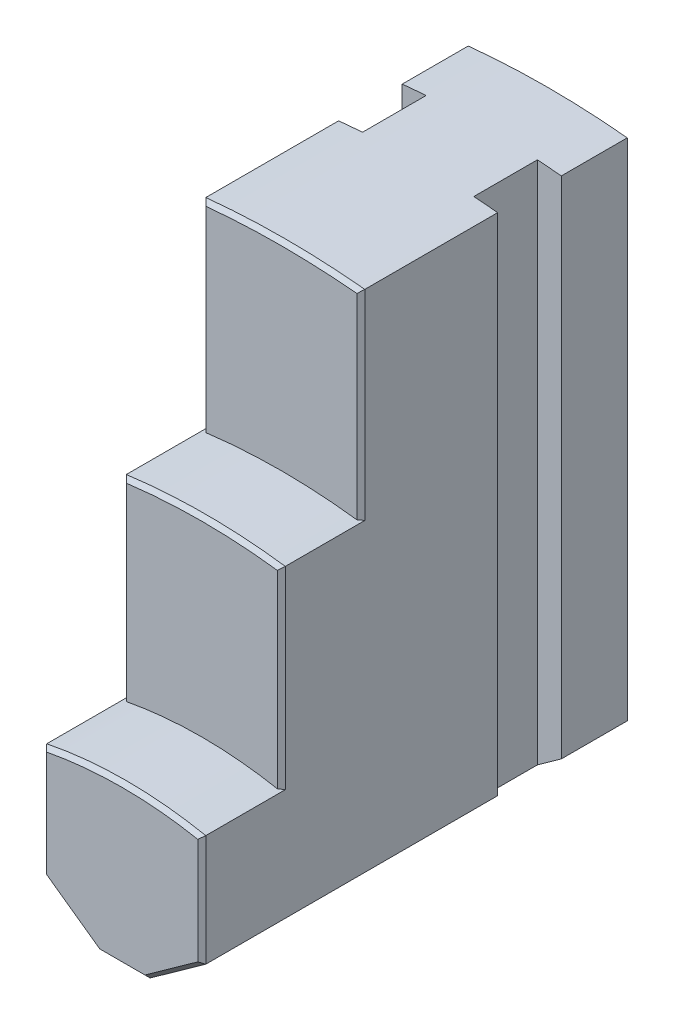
ISO-10303-21;
HEADER;
FILE_DESCRIPTION(('STEP AP214'),'2;1');
FILE_NAME('part.step','',(''),(''),'','','');
FILE_SCHEMA(('AUTOMOTIVE_DESIGN { 1 0 10303 214 1 1 1 1 }'));
ENDSEC;
DATA;
#1=APPLICATION_CONTEXT('core data for automotive mechanical design processes');
#2=APPLICATION_PROTOCOL_DEFINITION('international standard','automotive_design',2000,#1);
#3=PRODUCT_CONTEXT('',#1,'mechanical');
#4=PRODUCT('Part','Part','',(#3));
#5=PRODUCT_RELATED_PRODUCT_CATEGORY('part','',(#4));
#6=PRODUCT_DEFINITION_FORMATION('','',#4);
#7=PRODUCT_DEFINITION_CONTEXT('part definition',#1,'design');
#8=PRODUCT_DEFINITION('design','',#6,#7);
#9=PRODUCT_DEFINITION_SHAPE('','',#8);
#10=(LENGTH_UNIT() NAMED_UNIT(*) SI_UNIT(.MILLI.,.METRE.));
#11=(NAMED_UNIT(*) PLANE_ANGLE_UNIT() SI_UNIT($,.RADIAN.));
#12=(NAMED_UNIT(*) SI_UNIT($,.STERADIAN.) SOLID_ANGLE_UNIT());
#13=UNCERTAINTY_MEASURE_WITH_UNIT(LENGTH_MEASURE(1.E-05),#10,'distance_accuracy_value','');
#14=(GEOMETRIC_REPRESENTATION_CONTEXT(3) GLOBAL_UNCERTAINTY_ASSIGNED_CONTEXT((#13)) GLOBAL_UNIT_ASSIGNED_CONTEXT((#10,
#11,#12)) REPRESENTATION_CONTEXT('',''));
#15=CARTESIAN_POINT('',(0.,0.,0.));
#16=DIRECTION('',(0.,0.,1.));
#17=DIRECTION('',(1.,0.,0.));
#18=AXIS2_PLACEMENT_3D('',#15,#16,#17);
#19=CARTESIAN_POINT('',(10.,5.,32.5));
#20=DIRECTION('',(-1.,0.,0.));
#21=DIRECTION('',(0.,-1.,0.));
#22=AXIS2_PLACEMENT_3D('',#19,#20,#21);
#23=PLANE('',#22);
#24=DIRECTION('',(0.,0.,1.));
#25=VECTOR('',#24,1.);
#26=CARTESIAN_POINT('',(10.,19.0099990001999,22.5));
#27=LINE('',#26,#25);
#28=CARTESIAN_POINT('',(10.,19.0099990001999,32.));
#29=VERTEX_POINT('',#28);
#30=CARTESIAN_POINT('',(10.,19.0099990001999,22.));
#31=VERTEX_POINT('',#30);
#32=EDGE_CURVE('E361',#29,#31,#27,.F.);
#33=ORIENTED_EDGE('',*,*,#32,.F.);
#34=DIRECTION('',(0.,-1.,0.));
#35=VECTOR('',#34,1.);
#36=CARTESIAN_POINT('',(10.,5.,32.));
#37=LINE('',#36,#35);
#38=CARTESIAN_POINT('',(10.,5.,32.));
#39=VERTEX_POINT('',#38);
#40=EDGE_CURVE('E326',#29,#39,#37,.T.);
#41=ORIENTED_EDGE('',*,*,#40,.T.);
#42=DIRECTION('',(0.,0.,-1.));
#43=VECTOR('',#42,1.);
#44=CARTESIAN_POINT('',(10.,5.,32.5));
#45=LINE('',#44,#43);
#46=CARTESIAN_POINT('',(10.,5.,-4.7));
#47=VERTEX_POINT('',#46);
#48=EDGE_CURVE('E269',#39,#47,#45,.T.);
#49=ORIENTED_EDGE('',*,*,#48,.T.);
#50=DIRECTION('',(0.,-1.,0.));
#51=VECTOR('',#50,1.);
#52=CARTESIAN_POINT('',(10.,5.,-4.7));
#53=LINE('',#52,#51);
#54=CARTESIAN_POINT('',(10.,68.498743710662,-4.7));
#55=VERTEX_POINT('',#54);
#56=EDGE_CURVE('E288',#55,#47,#53,.T.);
#57=ORIENTED_EDGE('',*,*,#56,.F.);
#58=DIRECTION('',(0.,0.,-1.));
#59=VECTOR('',#58,1.);
#60=CARTESIAN_POINT('',(10.,68.498743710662,32.5));
#61=LINE('',#60,#59);
#62=CARTESIAN_POINT('',(10.,68.498743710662,12.));
#63=VERTEX_POINT('',#62);
#64=EDGE_CURVE('E224',#63,#55,#61,.T.);
#65=ORIENTED_EDGE('',*,*,#64,.F.);
#66=DIRECTION('',(0.,-1.,0.));
#67=VECTOR('',#66,1.);
#68=CARTESIAN_POINT('',(10.,43.3303437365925,12.));
#69=LINE('',#68,#67);
#70=CARTESIAN_POINT('',(10.,43.3303437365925,12.));
#71=VERTEX_POINT('',#70);
#72=EDGE_CURVE('E320',#63,#71,#69,.T.);
#73=ORIENTED_EDGE('',*,*,#72,.T.);
#74=DIRECTION('',(0.,0.,1.));
#75=VECTOR('',#74,1.);
#76=CARTESIAN_POINT('',(10.,43.3303437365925,12.5));
#77=LINE('',#76,#75);
#78=CARTESIAN_POINT('',(10.,43.3303437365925,22.));
#79=VERTEX_POINT('',#78);
#80=EDGE_CURVE('E220',#79,#71,#77,.F.);
#81=ORIENTED_EDGE('',*,*,#80,.F.);
#82=DIRECTION('',(0.,-1.,0.));
#83=VECTOR('',#82,1.);
#84=CARTESIAN_POINT('',(10.,19.0099990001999,22.));
#85=LINE('',#84,#83);
#86=EDGE_CURVE('E323',#79,#31,#85,.T.);
#87=ORIENTED_EDGE('',*,*,#86,.T.);
#88=EDGE_LOOP('',(#33,#41,#49,#57,#65,#73,#81,#87));
#89=FACE_BOUND('',#88,.T.);
#90=ADVANCED_FACE('F29',(#89),#23,.F.);
#91=CARTESIAN_POINT('',(-10.,5.,32.5));
#92=DIRECTION('',(1.,0.,0.));
#93=DIRECTION('',(0.,1.,0.));
#94=AXIS2_PLACEMENT_3D('',#91,#92,#93);
#95=PLANE('',#94);
#96=DIRECTION('',(0.,0.,-1.));
#97=VECTOR('',#96,1.);
#98=CARTESIAN_POINT('',(-10.,5.,32.5));
#99=LINE('',#98,#97);
#100=CARTESIAN_POINT('',(-10.,5.,32.));
#101=VERTEX_POINT('',#100);
#102=CARTESIAN_POINT('',(-10.,5.,-4.7));
#103=VERTEX_POINT('',#102);
#104=EDGE_CURVE('E276',#101,#103,#99,.T.);
#105=ORIENTED_EDGE('',*,*,#104,.F.);
#106=DIRECTION('',(0.,1.,0.));
#107=VECTOR('',#106,1.);
#108=CARTESIAN_POINT('',(-10.,19.0099990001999,32.));
#109=LINE('',#108,#107);
#110=CARTESIAN_POINT('',(-10.,19.0099990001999,32.));
#111=VERTEX_POINT('',#110);
#112=EDGE_CURVE('E311',#101,#111,#109,.T.);
#113=ORIENTED_EDGE('',*,*,#112,.T.);
#114=DIRECTION('',(0.,0.,1.));
#115=VECTOR('',#114,1.);
#116=CARTESIAN_POINT('',(-10.,19.0099990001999,22.5));
#117=LINE('',#116,#115);
#118=CARTESIAN_POINT('',(-10.,19.0099990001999,22.));
#119=VERTEX_POINT('',#118);
#120=EDGE_CURVE('E421',#119,#111,#117,.T.);
#121=ORIENTED_EDGE('',*,*,#120,.F.);
#122=DIRECTION('',(0.,1.,0.));
#123=VECTOR('',#122,1.);
#124=CARTESIAN_POINT('',(-10.,43.3303437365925,22.));
#125=LINE('',#124,#123);
#126=CARTESIAN_POINT('',(-10.,43.3303437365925,22.));
#127=VERTEX_POINT('',#126);
#128=EDGE_CURVE('E309',#119,#127,#125,.T.);
#129=ORIENTED_EDGE('',*,*,#128,.T.);
#130=DIRECTION('',(0.,0.,1.));
#131=VECTOR('',#130,1.);
#132=CARTESIAN_POINT('',(-10.,43.3303437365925,12.5));
#133=LINE('',#132,#131);
#134=CARTESIAN_POINT('',(-10.,43.3303437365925,12.));
#135=VERTEX_POINT('',#134);
#136=EDGE_CURVE('E360',#135,#127,#133,.T.);
#137=ORIENTED_EDGE('',*,*,#136,.F.);
#138=DIRECTION('',(0.,1.,0.));
#139=VECTOR('',#138,1.);
#140=CARTESIAN_POINT('',(-10.,68.498743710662,12.));
#141=LINE('',#140,#139);
#142=CARTESIAN_POINT('',(-10.,68.498743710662,12.));
#143=VERTEX_POINT('',#142);
#144=EDGE_CURVE('E307',#135,#143,#141,.T.);
#145=ORIENTED_EDGE('',*,*,#144,.T.);
#146=DIRECTION('',(0.,0.,-1.));
#147=VECTOR('',#146,1.);
#148=CARTESIAN_POINT('',(-10.,68.498743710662,32.5));
#149=LINE('',#148,#147);
#150=CARTESIAN_POINT('',(-10.,68.498743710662,-4.7));
#151=VERTEX_POINT('',#150);
#152=EDGE_CURVE('E279',#143,#151,#149,.T.);
#153=ORIENTED_EDGE('',*,*,#152,.T.);
#154=DIRECTION('',(0.,1.,0.));
#155=VECTOR('',#154,1.);
#156=CARTESIAN_POINT('',(-10.,5.,-4.7));
#157=LINE('',#156,#155);
#158=EDGE_CURVE('E243',#103,#151,#157,.T.);
#159=ORIENTED_EDGE('',*,*,#158,.F.);
#160=EDGE_LOOP('',(#105,#113,#121,#129,#137,#145,#153,#159));
#161=FACE_BOUND('',#160,.T.);
#162=ADVANCED_FACE('F376',(#161),#95,.F.);
#163=CARTESIAN_POINT('',(0.,-31.,32.5));
#164=DIRECTION('',(0.,0.,1.));
#165=DIRECTION('',(1.,0.,0.));
#166=AXIS2_PLACEMENT_3D('',#163,#164,#165);
#167=PLANE('',#166);
#168=CARTESIAN_POINT('',(0.,-31.,32.5));
#169=DIRECTION('',(0.,0.,1.));
#170=DIRECTION('',(1.,0.,0.));
#171=AXIS2_PLACEMENT_3D('',#168,#169,#170);
#172=CIRCLE('',#171,50.5);
#173=CARTESIAN_POINT('',(9.5,18.598387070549,32.5));
#174=VERTEX_POINT('',#173);
#175=CARTESIAN_POINT('',(-9.5,18.598387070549,32.5));
#176=VERTEX_POINT('',#175);
#177=EDGE_CURVE('E294',#174,#176,#172,.T.);
#178=ORIENTED_EDGE('',*,*,#177,.T.);
#179=DIRECTION('',(0.,-1.,0.));
#180=VECTOR('',#179,1.);
#181=CARTESIAN_POINT('',(-9.5,5.,32.5));
#182=LINE('',#181,#180);
#183=CARTESIAN_POINT('',(-9.5,5.2573089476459,32.5));
#184=VERTEX_POINT('',#183);
#185=EDGE_CURVE('E304',#176,#184,#182,.T.);
#186=ORIENTED_EDGE('',*,*,#185,.T.);
#187=DIRECTION('',(0.813733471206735,-0.581238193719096,0.));
#188=VECTOR('',#187,1.);
#189=CARTESIAN_POINT('',(-2.70938090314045,0.406866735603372,32.5));
#190=LINE('',#189,#188);
#191=CARTESIAN_POINT('',(-2.83976747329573,0.5,32.5));
#192=VERTEX_POINT('',#191);
#193=EDGE_CURVE('E302',#184,#192,#190,.T.);
#194=ORIENTED_EDGE('',*,*,#193,.T.);
#195=DIRECTION('',(1.,0.,0.));
#196=VECTOR('',#195,1.);
#197=CARTESIAN_POINT('',(3.,0.5,32.5));
#198=LINE('',#197,#196);
#199=CARTESIAN_POINT('',(2.83976747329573,0.5,32.5));
#200=VERTEX_POINT('',#199);
#201=EDGE_CURVE('E300',#192,#200,#198,.T.);
#202=ORIENTED_EDGE('',*,*,#201,.T.);
#203=DIRECTION('',(0.813733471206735,0.581238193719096,0.));
#204=VECTOR('',#203,1.);
#205=CARTESIAN_POINT('',(9.70938090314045,5.40686673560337,32.5));
#206=LINE('',#205,#204);
#207=CARTESIAN_POINT('',(9.5,5.2573089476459,32.5));
#208=VERTEX_POINT('',#207);
#209=EDGE_CURVE('E298',#200,#208,#206,.T.);
#210=ORIENTED_EDGE('',*,*,#209,.T.);
#211=DIRECTION('',(0.,1.,0.));
#212=VECTOR('',#211,1.);
#213=CARTESIAN_POINT('',(9.5,19.0099990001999,32.5));
#214=LINE('',#213,#212);
#215=EDGE_CURVE('E296',#208,#174,#214,.T.);
#216=ORIENTED_EDGE('',*,*,#215,.T.);
#217=EDGE_LOOP('',(#178,#186,#194,#202,#210,#216));
#218=FACE_BOUND('',#217,.T.);
#219=ADVANCED_FACE('F383',(#218),#167,.T.);
#220=CARTESIAN_POINT('',(0.,-31.,12.5));
#221=DIRECTION('',(0.,0.,1.));
#222=DIRECTION('',(1.,0.,0.));
#223=AXIS2_PLACEMENT_3D('',#220,#221,#222);
#224=CYLINDRICAL_SURFACE('',#223,75.);
#225=ORIENTED_EDGE('',*,*,#136,.T.);
#226=CARTESIAN_POINT('',(0.,-31.,22.));
#227=DIRECTION('',(0.,0.,1.));
#228=DIRECTION('',(1.,0.,0.));
#229=AXIS2_PLACEMENT_3D('',#226,#227,#228);
#230=CIRCLE('',#229,75.);
#231=EDGE_CURVE('E337',#127,#79,#230,.F.);
#232=ORIENTED_EDGE('',*,*,#231,.T.);
#233=ORIENTED_EDGE('',*,*,#80,.T.);
#234=CARTESIAN_POINT('',(0.,-31.,22.0000000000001));
#235=DIRECTION('',(0.707106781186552,0.,0.707106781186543));
#236=DIRECTION('',(-0.707106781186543,0.,0.707106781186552));
#237=AXIS2_PLACEMENT_3D('',#234,#235,#236);
#238=ELLIPSE('',#237,106.066017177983,75.);
#239=CARTESIAN_POINT('',(9.5,43.3959004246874,12.5));
#240=VERTEX_POINT('',#239);
#241=EDGE_CURVE('E37',#71,#240,#238,.T.);
#242=ORIENTED_EDGE('',*,*,#241,.T.);
#243=CARTESIAN_POINT('',(0.,-31.,12.5));
#244=DIRECTION('',(0.,0.,1.));
#245=DIRECTION('',(1.,0.,0.));
#246=AXIS2_PLACEMENT_3D('',#243,#244,#245);
#247=CIRCLE('',#246,75.);
#248=CARTESIAN_POINT('',(-9.5,43.3959004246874,12.5));
#249=VERTEX_POINT('',#248);
#250=EDGE_CURVE('E356',#240,#249,#247,.T.);
#251=ORIENTED_EDGE('',*,*,#250,.T.);
#252=CARTESIAN_POINT('',(0.,-31.,22.0000000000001));
#253=DIRECTION('',(-0.707106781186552,0.,0.707106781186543));
#254=DIRECTION('',(0.707106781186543,0.,0.707106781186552));
#255=AXIS2_PLACEMENT_3D('',#252,#253,#254);
#256=ELLIPSE('',#255,106.066017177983,75.);
#257=EDGE_CURVE('E11',#249,#135,#256,.T.);
#258=ORIENTED_EDGE('',*,*,#257,.T.);
#259=EDGE_LOOP('',(#225,#232,#233,#242,#251,#258));
#260=FACE_BOUND('',#259,.T.);
#261=ADVANCED_FACE('F355',(#260),#224,.T.);
#262=CARTESIAN_POINT('',(0.,-31.,32.5));
#263=DIRECTION('',(0.,0.,-1.));
#264=DIRECTION('',(-1.,0.,0.));
#265=AXIS2_PLACEMENT_3D('',#262,#263,#264);
#266=CYLINDRICAL_SURFACE('',#265,100.);
#267=ORIENTED_EDGE('',*,*,#152,.F.);
#268=CARTESIAN_POINT('',(0.,-31.,12.));
#269=DIRECTION('',(0.,0.,1.));
#270=DIRECTION('',(1.,0.,0.));
#271=AXIS2_PLACEMENT_3D('',#268,#269,#270);
#272=CIRCLE('',#271,100.);
#273=EDGE_CURVE('E344',#143,#63,#272,.F.);
#274=ORIENTED_EDGE('',*,*,#273,.T.);
#275=ORIENTED_EDGE('',*,*,#64,.T.);
#276=CARTESIAN_POINT('',(0.,-31.,-4.7));
#277=DIRECTION('',(0.,0.,-1.));
#278=DIRECTION('',(-1.,0.,0.));
#279=AXIS2_PLACEMENT_3D('',#276,#277,#278);
#280=CIRCLE('',#279,100.);
#281=CARTESIAN_POINT('',(7.,68.7546991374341,-4.7));
#282=VERTEX_POINT('',#281);
#283=EDGE_CURVE('E216',#282,#55,#280,.T.);
#284=ORIENTED_EDGE('',*,*,#283,.F.);
#285=DIRECTION('',(0.,0.,-1.));
#286=VECTOR('',#285,1.);
#287=CARTESIAN_POINT('',(7.,68.7546991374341,32.5));
#288=LINE('',#287,#286);
#289=CARTESIAN_POINT('',(7.,68.7546991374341,-12.7));
#290=VERTEX_POINT('',#289);
#291=EDGE_CURVE('E199',#290,#282,#288,.F.);
#292=ORIENTED_EDGE('',*,*,#291,.F.);
#293=CARTESIAN_POINT('',(0.,-31.,-12.7));
#294=DIRECTION('',(0.,0.,1.));
#295=DIRECTION('',(1.,0.,0.));
#296=AXIS2_PLACEMENT_3D('',#293,#294,#295);
#297=CIRCLE('',#296,100.);
#298=CARTESIAN_POINT('',(10.,68.498743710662,-12.7));
#299=VERTEX_POINT('',#298);
#300=EDGE_CURVE('E210',#299,#290,#297,.T.);
#301=ORIENTED_EDGE('',*,*,#300,.F.);
#302=CARTESIAN_POINT('',(10.,68.498743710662,-21.));
#303=VERTEX_POINT('',#302);
#304=EDGE_CURVE('E266',#299,#303,#61,.T.);
#305=ORIENTED_EDGE('',*,*,#304,.T.);
#306=CARTESIAN_POINT('',(0.,-31.,-21.));
#307=DIRECTION('',(0.,0.,1.));
#308=DIRECTION('',(1.,0.,0.));
#309=AXIS2_PLACEMENT_3D('',#306,#307,#308);
#310=CIRCLE('',#309,100.);
#311=CARTESIAN_POINT('',(-10.,68.498743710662,-21.));
#312=VERTEX_POINT('',#311);
#313=EDGE_CURVE('E248',#303,#312,#310,.T.);
#314=ORIENTED_EDGE('',*,*,#313,.T.);
#315=CARTESIAN_POINT('',(-10.,68.498743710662,-12.7));
#316=VERTEX_POINT('',#315);
#317=EDGE_CURVE('E278',#316,#312,#149,.T.);
#318=ORIENTED_EDGE('',*,*,#317,.F.);
#319=CARTESIAN_POINT('',(0.,-31.,-12.7));
#320=DIRECTION('',(0.,0.,1.));
#321=DIRECTION('',(1.,0.,0.));
#322=AXIS2_PLACEMENT_3D('',#319,#320,#321);
#323=CIRCLE('',#322,100.);
#324=CARTESIAN_POINT('',(-7.,68.7546991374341,-12.7));
#325=VERTEX_POINT('',#324);
#326=EDGE_CURVE('E239',#325,#316,#323,.T.);
#327=ORIENTED_EDGE('',*,*,#326,.F.);
#328=DIRECTION('',(0.,0.,-1.));
#329=VECTOR('',#328,1.);
#330=CARTESIAN_POINT('',(-7.,68.7546991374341,32.5));
#331=LINE('',#330,#329);
#332=CARTESIAN_POINT('',(-7.,68.7546991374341,-4.7));
#333=VERTEX_POINT('',#332);
#334=EDGE_CURVE('E241',#333,#325,#331,.T.);
#335=ORIENTED_EDGE('',*,*,#334,.F.);
#336=CARTESIAN_POINT('',(0.,-31.,-4.7));
#337=DIRECTION('',(0.,0.,-1.));
#338=DIRECTION('',(-1.,0.,0.));
#339=AXIS2_PLACEMENT_3D('',#336,#337,#338);
#340=CIRCLE('',#339,100.);
#341=EDGE_CURVE('E246',#151,#333,#340,.T.);
#342=ORIENTED_EDGE('',*,*,#341,.F.);
#343=EDGE_LOOP('',(#267,#274,#275,#284,#292,#301,#305,#314,#318,#327,#335,#342));
#344=FACE_BOUND('',#343,.T.);
#345=ADVANCED_FACE('F31',(#344),#266,.T.);
#346=CARTESIAN_POINT('',(3.,0.,32.5));
#347=DIRECTION('',(-0.581238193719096,0.813733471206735,0.));
#348=DIRECTION('',(-0.813733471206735,-0.581238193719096,0.));
#349=AXIS2_PLACEMENT_3D('',#346,#347,#348);
#350=PLANE('',#349);
#351=ORIENTED_EDGE('',*,*,#48,.F.);
#352=DIRECTION('',(-0.813733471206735,-0.581238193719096,0.));
#353=VECTOR('',#352,1.);
#354=CARTESIAN_POINT('',(3.,0.,32.));
#355=LINE('',#354,#353);
#356=CARTESIAN_POINT('',(3.,0.,32.));
#357=VERTEX_POINT('',#356);
#358=EDGE_CURVE('E318',#39,#357,#355,.T.);
#359=ORIENTED_EDGE('',*,*,#358,.T.);
#360=DIRECTION('',(0.,0.,-1.));
#361=VECTOR('',#360,1.);
#362=CARTESIAN_POINT('',(3.,0.,32.5));
#363=LINE('',#362,#361);
#364=CARTESIAN_POINT('',(3.,0.,-21.));
#365=VERTEX_POINT('',#364);
#366=EDGE_CURVE('E271',#357,#365,#363,.T.);
#367=ORIENTED_EDGE('',*,*,#366,.T.);
#368=DIRECTION('',(0.813733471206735,0.581238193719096,0.));
#369=VECTOR('',#368,1.);
#370=CARTESIAN_POINT('',(3.,0.,-21.));
#371=LINE('',#370,#369);
#372=CARTESIAN_POINT('',(10.,5.,-21.));
#373=VERTEX_POINT('',#372);
#374=EDGE_CURVE('E260',#365,#373,#371,.T.);
#375=ORIENTED_EDGE('',*,*,#374,.T.);
#376=CARTESIAN_POINT('',(10.,5.,-12.7));
#377=VERTEX_POINT('',#376);
#378=EDGE_CURVE('E268',#377,#373,#45,.T.);
#379=ORIENTED_EDGE('',*,*,#378,.F.);
#380=DIRECTION('',(0.813733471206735,0.581238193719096,0.));
#381=VECTOR('',#380,1.);
#382=CARTESIAN_POINT('',(3.,0.,-12.7));
#383=LINE('',#382,#381);
#384=CARTESIAN_POINT('',(7.,2.85714285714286,-12.7));
#385=VERTEX_POINT('',#384);
#386=EDGE_CURVE('E225',#385,#377,#383,.T.);
#387=ORIENTED_EDGE('',*,*,#386,.F.);
#388=DIRECTION('',(0.,0.,-1.));
#389=VECTOR('',#388,1.);
#390=CARTESIAN_POINT('',(7.,2.85714285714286,32.5));
#391=LINE('',#390,#389);
#392=CARTESIAN_POINT('',(7.00000000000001,2.85714285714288,-4.7));
#393=VERTEX_POINT('',#392);
#394=EDGE_CURVE('E292',#393,#385,#391,.T.);
#395=ORIENTED_EDGE('',*,*,#394,.F.);
#396=DIRECTION('',(-0.813733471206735,-0.581238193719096,0.));
#397=VECTOR('',#396,1.);
#398=CARTESIAN_POINT('',(3.,0.,-4.7));
#399=LINE('',#398,#397);
#400=EDGE_CURVE('E219',#47,#393,#399,.T.);
#401=ORIENTED_EDGE('',*,*,#400,.F.);
#402=EDGE_LOOP('',(#351,#359,#367,#375,#379,#387,#395,#401));
#403=FACE_BOUND('',#402,.T.);
#404=ADVANCED_FACE('F390',(#403),#350,.F.);
#405=DIRECTION('',(0.,1.,0.));
#406=VECTOR('',#405,1.);
#407=CARTESIAN_POINT('',(10.,5.,-12.7));
#408=LINE('',#407,#406);
#409=EDGE_CURVE('E290',#377,#299,#408,.T.);
#410=ORIENTED_EDGE('',*,*,#409,.F.);
#411=ORIENTED_EDGE('',*,*,#378,.T.);
#412=DIRECTION('',(0.,1.,0.));
#413=VECTOR('',#412,1.);
#414=CARTESIAN_POINT('',(10.,5.,-21.));
#415=LINE('',#414,#413);
#416=EDGE_CURVE('E263',#373,#303,#415,.T.);
#417=ORIENTED_EDGE('',*,*,#416,.T.);
#418=ORIENTED_EDGE('',*,*,#304,.F.);
#419=EDGE_LOOP('',(#410,#411,#417,#418));
#420=FACE_BOUND('',#419,.T.);
#421=ADVANCED_FACE('F379',(#420),#23,.F.);
#422=DIRECTION('',(0.,-1.,0.));
#423=VECTOR('',#422,1.);
#424=CARTESIAN_POINT('',(-10.,5.,-12.7));
#425=LINE('',#424,#423);
#426=CARTESIAN_POINT('',(-10.,5.,-12.7));
#427=VERTEX_POINT('',#426);
#428=EDGE_CURVE('E237',#316,#427,#425,.T.);
#429=ORIENTED_EDGE('',*,*,#428,.F.);
#430=ORIENTED_EDGE('',*,*,#317,.T.);
#431=DIRECTION('',(0.,-1.,0.));
#432=VECTOR('',#431,1.);
#433=CARTESIAN_POINT('',(-10.,5.,-21.));
#434=LINE('',#433,#432);
#435=CARTESIAN_POINT('',(-10.,5.,-21.));
#436=VERTEX_POINT('',#435);
#437=EDGE_CURVE('E251',#312,#436,#434,.T.);
#438=ORIENTED_EDGE('',*,*,#437,.T.);
#439=EDGE_CURVE('E275',#427,#436,#99,.T.);
#440=ORIENTED_EDGE('',*,*,#439,.F.);
#441=EDGE_LOOP('',(#429,#430,#438,#440));
#442=FACE_BOUND('',#441,.T.);
#443=ADVANCED_FACE('F385',(#442),#95,.F.);
#444=CARTESIAN_POINT('',(-3.,0.,32.5));
#445=DIRECTION('',(0.581238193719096,0.813733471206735,0.));
#446=DIRECTION('',(-0.813733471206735,0.581238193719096,0.));
#447=AXIS2_PLACEMENT_3D('',#444,#445,#446);
#448=PLANE('',#447);
#449=DIRECTION('',(0.,0.,-1.));
#450=VECTOR('',#449,1.);
#451=CARTESIAN_POINT('',(-3.,0.,32.5));
#452=LINE('',#451,#450);
#453=CARTESIAN_POINT('',(-3.,0.,32.));
#454=VERTEX_POINT('',#453);
#455=CARTESIAN_POINT('',(-3.,0.,-21.));
#456=VERTEX_POINT('',#455);
#457=EDGE_CURVE('E273',#454,#456,#452,.T.);
#458=ORIENTED_EDGE('',*,*,#457,.F.);
#459=DIRECTION('',(-0.813733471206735,0.581238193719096,0.));
#460=VECTOR('',#459,1.);
#461=CARTESIAN_POINT('',(-10.,5.,32.));
#462=LINE('',#461,#460);
#463=EDGE_CURVE('E314',#454,#101,#462,.T.);
#464=ORIENTED_EDGE('',*,*,#463,.T.);
#465=ORIENTED_EDGE('',*,*,#104,.T.);
#466=DIRECTION('',(-0.813733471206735,0.581238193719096,0.));
#467=VECTOR('',#466,1.);
#468=CARTESIAN_POINT('',(-3.,0.,-4.7));
#469=LINE('',#468,#467);
#470=CARTESIAN_POINT('',(-7.,2.85714285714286,-4.7));
#471=VERTEX_POINT('',#470);
#472=EDGE_CURVE('E285',#471,#103,#469,.T.);
#473=ORIENTED_EDGE('',*,*,#472,.F.);
#474=DIRECTION('',(0.,0.,1.));
#475=VECTOR('',#474,1.);
#476=CARTESIAN_POINT('',(-7.,2.85714285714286,32.5));
#477=LINE('',#476,#475);
#478=CARTESIAN_POINT('',(-7.00000000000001,2.85714285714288,-12.7));
#479=VERTEX_POINT('',#478);
#480=EDGE_CURVE('E283',#479,#471,#477,.T.);
#481=ORIENTED_EDGE('',*,*,#480,.F.);
#482=DIRECTION('',(0.813733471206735,-0.581238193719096,0.));
#483=VECTOR('',#482,1.);
#484=CARTESIAN_POINT('',(-3.,0.,-12.7));
#485=LINE('',#484,#483);
#486=EDGE_CURVE('E281',#427,#479,#485,.T.);
#487=ORIENTED_EDGE('',*,*,#486,.F.);
#488=ORIENTED_EDGE('',*,*,#439,.T.);
#489=DIRECTION('',(0.813733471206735,-0.581238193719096,0.));
#490=VECTOR('',#489,1.);
#491=CARTESIAN_POINT('',(-3.,0.,-21.));
#492=LINE('',#491,#490);
#493=EDGE_CURVE('E254',#436,#456,#492,.T.);
#494=ORIENTED_EDGE('',*,*,#493,.T.);
#495=EDGE_LOOP('',(#458,#464,#465,#473,#481,#487,#488,#494));
#496=FACE_BOUND('',#495,.T.);
#497=ADVANCED_FACE('F396',(#496),#448,.F.);
#498=CARTESIAN_POINT('',(-3.,0.,32.5));
#499=DIRECTION('',(0.,1.,0.));
#500=DIRECTION('',(0.,0.,1.));
#501=AXIS2_PLACEMENT_3D('',#498,#499,#500);
#502=PLANE('',#501);
#503=ORIENTED_EDGE('',*,*,#366,.F.);
#504=DIRECTION('',(-1.,0.,0.));
#505=VECTOR('',#504,1.);
#506=CARTESIAN_POINT('',(-3.,0.,32.));
#507=LINE('',#506,#505);
#508=EDGE_CURVE('E316',#357,#454,#507,.T.);
#509=ORIENTED_EDGE('',*,*,#508,.T.);
#510=ORIENTED_EDGE('',*,*,#457,.T.);
#511=DIRECTION('',(1.,0.,0.));
#512=VECTOR('',#511,1.);
#513=CARTESIAN_POINT('',(-3.,0.,-21.));
#514=LINE('',#513,#512);
#515=EDGE_CURVE('E257',#456,#365,#514,.T.);
#516=ORIENTED_EDGE('',*,*,#515,.T.);
#517=EDGE_LOOP('',(#503,#509,#510,#516));
#518=FACE_BOUND('',#517,.T.);
#519=ADVANCED_FACE('F493',(#518),#502,.F.);
#520=CARTESIAN_POINT('',(0.,-31.,-21.));
#521=DIRECTION('',(0.,0.,1.));
#522=DIRECTION('',(1.,0.,0.));
#523=AXIS2_PLACEMENT_3D('',#520,#521,#522);
#524=PLANE('',#523);
#525=ORIENTED_EDGE('',*,*,#313,.F.);
#526=ORIENTED_EDGE('',*,*,#416,.F.);
#527=ORIENTED_EDGE('',*,*,#374,.F.);
#528=ORIENTED_EDGE('',*,*,#515,.F.);
#529=ORIENTED_EDGE('',*,*,#493,.F.);
#530=ORIENTED_EDGE('',*,*,#437,.F.);
#531=EDGE_LOOP('',(#525,#526,#527,#528,#529,#530));
#532=FACE_BOUND('',#531,.T.);
#533=ADVANCED_FACE('F411',(#532),#524,.F.);
#534=CARTESIAN_POINT('',(-17.,69.,-4.7));
#535=DIRECTION('',(0.,0.,-1.));
#536=DIRECTION('',(-1.,0.,0.));
#537=AXIS2_PLACEMENT_3D('',#534,#535,#536);
#538=PLANE('',#537);
#539=ORIENTED_EDGE('',*,*,#341,.T.);
#540=DIRECTION('',(0.,-1.,0.));
#541=VECTOR('',#540,1.);
#542=CARTESIAN_POINT('',(-7.,69.,-4.7));
#543=LINE('',#542,#541);
#544=EDGE_CURVE('E234',#333,#471,#543,.T.);
#545=ORIENTED_EDGE('',*,*,#544,.T.);
#546=ORIENTED_EDGE('',*,*,#472,.T.);
#547=ORIENTED_EDGE('',*,*,#158,.T.);
#548=EDGE_LOOP('',(#539,#545,#546,#547));
#549=FACE_BOUND('',#548,.T.);
#550=ADVANCED_FACE('F487',(#549),#538,.T.);
#551=CARTESIAN_POINT('',(-7.,69.,-12.7));
#552=DIRECTION('',(-1.,0.,0.));
#553=DIRECTION('',(0.,0.,1.));
#554=AXIS2_PLACEMENT_3D('',#551,#552,#553);
#555=PLANE('',#554);
#556=ORIENTED_EDGE('',*,*,#334,.T.);
#557=DIRECTION('',(0.,-1.,0.));
#558=VECTOR('',#557,1.);
#559=CARTESIAN_POINT('',(-7.,69.,-12.7));
#560=LINE('',#559,#558);
#561=EDGE_CURVE('E209',#325,#479,#560,.T.);
#562=ORIENTED_EDGE('',*,*,#561,.T.);
#563=ORIENTED_EDGE('',*,*,#480,.T.);
#564=ORIENTED_EDGE('',*,*,#544,.F.);
#565=EDGE_LOOP('',(#556,#562,#563,#564));
#566=FACE_BOUND('',#565,.T.);
#567=ADVANCED_FACE('F483',(#566),#555,.T.);
#568=CARTESIAN_POINT('',(-17.,69.,-12.7));
#569=DIRECTION('',(0.,0.,1.));
#570=DIRECTION('',(1.,0.,0.));
#571=AXIS2_PLACEMENT_3D('',#568,#569,#570);
#572=PLANE('',#571);
#573=ORIENTED_EDGE('',*,*,#326,.T.);
#574=ORIENTED_EDGE('',*,*,#428,.T.);
#575=ORIENTED_EDGE('',*,*,#486,.T.);
#576=ORIENTED_EDGE('',*,*,#561,.F.);
#577=EDGE_LOOP('',(#573,#574,#575,#576));
#578=FACE_BOUND('',#577,.T.);
#579=ADVANCED_FACE('F478',(#578),#572,.T.);
#580=CARTESIAN_POINT('',(7.,69.,-12.7));
#581=DIRECTION('',(1.,0.,0.));
#582=DIRECTION('',(0.,0.,-1.));
#583=AXIS2_PLACEMENT_3D('',#580,#581,#582);
#584=PLANE('',#583);
#585=ORIENTED_EDGE('',*,*,#291,.T.);
#586=DIRECTION('',(0.,-1.,0.));
#587=VECTOR('',#586,1.);
#588=CARTESIAN_POINT('',(7.,69.,-4.7));
#589=LINE('',#588,#587);
#590=EDGE_CURVE('E202',#282,#393,#589,.T.);
#591=ORIENTED_EDGE('',*,*,#590,.T.);
#592=ORIENTED_EDGE('',*,*,#394,.T.);
#593=DIRECTION('',(0.,-1.,0.));
#594=VECTOR('',#593,1.);
#595=CARTESIAN_POINT('',(7.,69.,-12.7));
#596=LINE('',#595,#594);
#597=EDGE_CURVE('E205',#290,#385,#596,.T.);
#598=ORIENTED_EDGE('',*,*,#597,.F.);
#599=EDGE_LOOP('',(#585,#591,#592,#598));
#600=FACE_BOUND('',#599,.T.);
#601=ADVANCED_FACE('F201',(#600),#584,.T.);
#602=CARTESIAN_POINT('',(17.,69.,-12.7));
#603=DIRECTION('',(0.,0.,1.));
#604=DIRECTION('',(1.,0.,0.));
#605=AXIS2_PLACEMENT_3D('',#602,#603,#604);
#606=PLANE('',#605);
#607=ORIENTED_EDGE('',*,*,#300,.T.);
#608=ORIENTED_EDGE('',*,*,#597,.T.);
#609=ORIENTED_EDGE('',*,*,#386,.T.);
#610=ORIENTED_EDGE('',*,*,#409,.T.);
#611=EDGE_LOOP('',(#607,#608,#609,#610));
#612=FACE_BOUND('',#611,.T.);
#613=ADVANCED_FACE('F416',(#612),#606,.T.);
#614=CARTESIAN_POINT('',(17.,69.,-4.7));
#615=DIRECTION('',(0.,0.,-1.));
#616=DIRECTION('',(-1.,0.,0.));
#617=AXIS2_PLACEMENT_3D('',#614,#615,#616);
#618=PLANE('',#617);
#619=ORIENTED_EDGE('',*,*,#283,.T.);
#620=ORIENTED_EDGE('',*,*,#56,.T.);
#621=ORIENTED_EDGE('',*,*,#400,.T.);
#622=ORIENTED_EDGE('',*,*,#590,.F.);
#623=EDGE_LOOP('',(#619,#620,#621,#622));
#624=FACE_BOUND('',#623,.T.);
#625=ADVANCED_FACE('F214',(#624),#618,.T.);
#626=CARTESIAN_POINT('',(0.,0.,12.5));
#627=DIRECTION('',(0.,0.,1.));
#628=DIRECTION('',(1.,0.,0.));
#629=AXIS2_PLACEMENT_3D('',#626,#627,#628);
#630=PLANE('',#629);
#631=ORIENTED_EDGE('',*,*,#250,.F.);
#632=DIRECTION('',(0.,1.,0.));
#633=VECTOR('',#632,1.);
#634=CARTESIAN_POINT('',(9.5,68.498743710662,12.5));
#635=LINE('',#634,#633);
#636=CARTESIAN_POINT('',(9.5,68.0454441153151,12.5));
#637=VERTEX_POINT('',#636);
#638=EDGE_CURVE('E342',#240,#637,#635,.T.);
#639=ORIENTED_EDGE('',*,*,#638,.T.);
#640=CARTESIAN_POINT('',(0.,-31.,12.5));
#641=DIRECTION('',(0.,0.,1.));
#642=DIRECTION('',(1.,0.,0.));
#643=AXIS2_PLACEMENT_3D('',#640,#641,#642);
#644=CIRCLE('',#643,99.5);
#645=CARTESIAN_POINT('',(-9.5,68.0454441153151,12.5));
#646=VERTEX_POINT('',#645);
#647=EDGE_CURVE('E44',#637,#646,#644,.T.);
#648=ORIENTED_EDGE('',*,*,#647,.T.);
#649=DIRECTION('',(0.,-1.,0.));
#650=VECTOR('',#649,1.);
#651=CARTESIAN_POINT('',(-9.5,43.3303437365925,12.5));
#652=LINE('',#651,#650);
#653=EDGE_CURVE('E340',#646,#249,#652,.T.);
#654=ORIENTED_EDGE('',*,*,#653,.T.);
#655=EDGE_LOOP('',(#631,#639,#648,#654));
#656=FACE_BOUND('',#655,.T.);
#657=ADVANCED_FACE('F359',(#656),#630,.T.);
#658=CARTESIAN_POINT('',(0.,-31.,22.5));
#659=DIRECTION('',(0.,0.,1.));
#660=DIRECTION('',(1.,0.,0.));
#661=AXIS2_PLACEMENT_3D('',#658,#659,#660);
#662=CYLINDRICAL_SURFACE('',#661,51.);
#663=ORIENTED_EDGE('',*,*,#120,.T.);
#664=CARTESIAN_POINT('',(0.,-31.,32.));
#665=DIRECTION('',(0.,0.,1.));
#666=DIRECTION('',(1.,0.,0.));
#667=AXIS2_PLACEMENT_3D('',#664,#665,#666);
#668=CIRCLE('',#667,51.);
#669=EDGE_CURVE('E328',#111,#29,#668,.F.);
#670=ORIENTED_EDGE('',*,*,#669,.T.);
#671=ORIENTED_EDGE('',*,*,#32,.T.);
#672=CARTESIAN_POINT('',(0.,-31.,32.0000000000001));
#673=DIRECTION('',(0.70710678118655,0.,0.707106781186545));
#674=DIRECTION('',(-0.707106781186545,0.,0.70710678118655));
#675=AXIS2_PLACEMENT_3D('',#672,#673,#674);
#676=ELLIPSE('',#675,72.1248916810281,51.);
#677=CARTESIAN_POINT('',(9.5,19.1073846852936,22.5));
#678=VERTEX_POINT('',#677);
#679=EDGE_CURVE('E346',#31,#678,#676,.T.);
#680=ORIENTED_EDGE('',*,*,#679,.T.);
#681=CARTESIAN_POINT('',(0.,-31.,22.5));
#682=DIRECTION('',(0.,0.,1.));
#683=DIRECTION('',(1.,0.,0.));
#684=AXIS2_PLACEMENT_3D('',#681,#682,#683);
#685=CIRCLE('',#684,51.);
#686=CARTESIAN_POINT('',(-9.5,19.1073846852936,22.5));
#687=VERTEX_POINT('',#686);
#688=EDGE_CURVE('E424',#678,#687,#685,.T.);
#689=ORIENTED_EDGE('',*,*,#688,.T.);
#690=CARTESIAN_POINT('',(0.,-31.,32.0000000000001));
#691=DIRECTION('',(-0.70710678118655,0.,0.707106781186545));
#692=DIRECTION('',(0.707106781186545,0.,0.70710678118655));
#693=AXIS2_PLACEMENT_3D('',#690,#691,#692);
#694=ELLIPSE('',#693,72.1248916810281,51.);
#695=EDGE_CURVE('E348',#687,#119,#694,.T.);
#696=ORIENTED_EDGE('',*,*,#695,.T.);
#697=EDGE_LOOP('',(#663,#670,#671,#680,#689,#696));
#698=FACE_BOUND('',#697,.T.);
#699=ADVANCED_FACE('F463',(#698),#662,.T.);
#700=CARTESIAN_POINT('',(0.,0.,22.5));
#701=DIRECTION('',(0.,0.,1.));
#702=DIRECTION('',(1.,0.,0.));
#703=AXIS2_PLACEMENT_3D('',#700,#701,#702);
#704=PLANE('',#703);
#705=ORIENTED_EDGE('',*,*,#688,.F.);
#706=DIRECTION('',(0.,1.,0.));
#707=VECTOR('',#706,1.);
#708=CARTESIAN_POINT('',(9.5,43.3303437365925,22.5));
#709=LINE('',#708,#707);
#710=CARTESIAN_POINT('',(9.5,42.8918128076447,22.5));
#711=VERTEX_POINT('',#710);
#712=EDGE_CURVE('E334',#678,#711,#709,.T.);
#713=ORIENTED_EDGE('',*,*,#712,.T.);
#714=CARTESIAN_POINT('',(0.,-31.,22.5));
#715=DIRECTION('',(0.,0.,1.));
#716=DIRECTION('',(1.,0.,0.));
#717=AXIS2_PLACEMENT_3D('',#714,#715,#716);
#718=CIRCLE('',#717,74.5);
#719=CARTESIAN_POINT('',(-9.5,42.8918128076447,22.5));
#720=VERTEX_POINT('',#719);
#721=EDGE_CURVE('E330',#711,#720,#718,.T.);
#722=ORIENTED_EDGE('',*,*,#721,.T.);
#723=DIRECTION('',(0.,-1.,0.));
#724=VECTOR('',#723,1.);
#725=CARTESIAN_POINT('',(-9.5,19.0099990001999,22.5));
#726=LINE('',#725,#724);
#727=EDGE_CURVE('E332',#720,#687,#726,.T.);
#728=ORIENTED_EDGE('',*,*,#727,.T.);
#729=EDGE_LOOP('',(#705,#713,#722,#728));
#730=FACE_BOUND('',#729,.T.);
#731=ADVANCED_FACE('F461',(#730),#704,.T.);
#732=CARTESIAN_POINT('',(-13.9392677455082,-11.4850251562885,32.5));
#733=DIRECTION('',(0.410997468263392,-0.575396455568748,0.70710678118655));
#734=DIRECTION('',(0.,-0.775645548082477,-0.6311687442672));
#735=AXIS2_PLACEMENT_3D('',#732,#733,#734);
#736=PLANE('',#735);
#737=DIRECTION('',(0.220999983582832,-0.689622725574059,-0.689622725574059));
#738=VECTOR('',#737,1.);
#739=CARTESIAN_POINT('',(3.84685980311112,-2.64259642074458,29.3574035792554));
#740=LINE('',#739,#738);
#741=EDGE_CURVE('E430',#357,#200,#740,.F.);
#742=ORIENTED_EDGE('',*,*,#741,.F.);
#743=ORIENTED_EDGE('',*,*,#358,.F.);
#744=DIRECTION('',(0.664480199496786,-0.341953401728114,-0.664480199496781));
#745=VECTOR('',#744,1.);
#746=CARTESIAN_POINT('',(17.7384315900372,1.01766462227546,24.2615684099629));
#747=LINE('',#746,#745);
#748=EDGE_CURVE('E427',#208,#39,#747,.T.);
#749=ORIENTED_EDGE('',*,*,#748,.F.);
#750=ORIENTED_EDGE('',*,*,#209,.F.);
#751=EDGE_LOOP('',(#742,#743,#749,#750));
#752=FACE_BOUND('',#751,.T.);
#753=ADVANCED_FACE('F453',(#752),#736,.T.);
#754=CARTESIAN_POINT('',(9.5,-31.,32.5));
#755=DIRECTION('',(0.707106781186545,0.,0.70710678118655));
#756=DIRECTION('',(0.70710678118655,0.,-0.707106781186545));
#757=AXIS2_PLACEMENT_3D('',#754,#755,#756);
#758=PLANE('',#757);
#759=ORIENTED_EDGE('',*,*,#748,.T.);
#760=ORIENTED_EDGE('',*,*,#40,.F.);
#761=CARTESIAN_POINT('',(9.5,18.598387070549,32.5));
#762=CARTESIAN_POINT('',(9.58324618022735,18.6672007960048,32.4167538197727));
#763=CARTESIAN_POINT('',(9.6665359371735,18.7359086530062,32.3334640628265));
#764=CARTESIAN_POINT('',(9.83320260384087,18.8731126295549,32.1667973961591));
#765=CARTESIAN_POINT('',(9.91657951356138,18.9416087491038,32.0834204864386));
#766=CARTESIAN_POINT('',(10.,19.0099990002,32.));
#767=B_SPLINE_CURVE_WITH_KNOTS('',3,(#761,#762,#763,#764,#765,#766),.UNSPECIFIED.,.F.,.F.,(4,2,
4),(0.,0.409091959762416,0.81818391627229),.UNSPECIFIED.);
#768=EDGE_CURVE('E433',#174,#29,#767,.T.);
#769=ORIENTED_EDGE('',*,*,#768,.F.);
#770=ORIENTED_EDGE('',*,*,#215,.F.);
#771=EDGE_LOOP('',(#759,#760,#769,#770));
#772=FACE_BOUND('',#771,.T.);
#773=ADVANCED_FACE('F447',(#772),#758,.T.);
#774=CARTESIAN_POINT('',(0.,0.5,32.5));
#775=DIRECTION('',(0.,-0.707106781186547,0.707106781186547));
#776=DIRECTION('',(0.,-0.707106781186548,-0.707106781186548));
#777=AXIS2_PLACEMENT_3D('',#774,#775,#776);
#778=PLANE('',#777);
#779=ORIENTED_EDGE('',*,*,#741,.T.);
#780=ORIENTED_EDGE('',*,*,#201,.F.);
#781=DIRECTION('',(-0.220999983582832,-0.689622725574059,-0.689622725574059));
#782=VECTOR('',#781,1.);
#783=CARTESIAN_POINT('',(-2.70107041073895,0.932799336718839,32.9327993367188));
#784=LINE('',#783,#782);
#785=EDGE_CURVE('E441',#454,#192,#784,.F.);
#786=ORIENTED_EDGE('',*,*,#785,.F.);
#787=ORIENTED_EDGE('',*,*,#508,.F.);
#788=EDGE_LOOP('',(#779,#780,#786,#787));
#789=FACE_BOUND('',#788,.T.);
#790=ADVANCED_FACE('F452',(#789),#778,.T.);
#791=CARTESIAN_POINT('',(0.,-31.,32.5));
#792=DIRECTION('',(0.,0.,-1.));
#793=DIRECTION('',(-1.,0.,0.));
#794=AXIS2_PLACEMENT_3D('',#791,#792,#793);
#795=CONICAL_SURFACE('',#794,50.5,0.785398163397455);
#796=ORIENTED_EDGE('',*,*,#768,.T.);
#797=ORIENTED_EDGE('',*,*,#669,.F.);
#798=CARTESIAN_POINT('',(-10.,19.0099990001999,32.));
#799=CARTESIAN_POINT('',(-9.91657951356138,18.9416087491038,32.0834204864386));
#800=CARTESIAN_POINT('',(-9.83320260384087,18.8731126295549,32.1667973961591));
#801=CARTESIAN_POINT('',(-9.66653593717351,18.7359086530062,32.3334640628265));
#802=CARTESIAN_POINT('',(-9.58324618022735,18.6672007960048,32.4167538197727));
#803=CARTESIAN_POINT('',(-9.5,18.598387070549,32.5));
#804=B_SPLINE_CURVE_WITH_KNOTS('',3,(#798,#799,#800,#801,#802,#803),.UNSPECIFIED.,.F.,.F.,(4,2,
4),(0.,0.409091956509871,0.818183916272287),.UNSPECIFIED.);
#805=EDGE_CURVE('E505',#176,#111,#804,.F.);
#806=ORIENTED_EDGE('',*,*,#805,.F.);
#807=ORIENTED_EDGE('',*,*,#177,.F.);
#808=EDGE_LOOP('',(#796,#797,#806,#807));
#809=FACE_BOUND('',#808,.T.);
#810=ADVANCED_FACE('F443',(#809),#795,.T.);
#811=CARTESIAN_POINT('',(13.9392677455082,-11.4850251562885,32.5));
#812=DIRECTION('',(-0.410997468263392,-0.575396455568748,0.70710678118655));
#813=DIRECTION('',(0.,-0.775645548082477,-0.6311687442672));
#814=AXIS2_PLACEMENT_3D('',#811,#812,#813);
#815=PLANE('',#814);
#816=ORIENTED_EDGE('',*,*,#785,.T.);
#817=ORIENTED_EDGE('',*,*,#193,.F.);
#818=DIRECTION('',(-0.664480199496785,-0.341953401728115,-0.664480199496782));
#819=VECTOR('',#818,1.);
#820=CARTESIAN_POINT('',(-2.95498219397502,8.62549223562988,39.0450178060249));
#821=LINE('',#820,#819);
#822=EDGE_CURVE('E508',#101,#184,#821,.F.);
#823=ORIENTED_EDGE('',*,*,#822,.F.);
#824=ORIENTED_EDGE('',*,*,#463,.F.);
#825=EDGE_LOOP('',(#816,#817,#823,#824));
#826=FACE_BOUND('',#825,.T.);
#827=ADVANCED_FACE('F455',(#826),#815,.T.);
#828=CARTESIAN_POINT('',(-9.5,-31.,32.5));
#829=DIRECTION('',(-0.707106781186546,0.,0.707106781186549));
#830=DIRECTION('',(0.707106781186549,0.,0.707106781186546));
#831=AXIS2_PLACEMENT_3D('',#828,#829,#830);
#832=PLANE('',#831);
#833=ORIENTED_EDGE('',*,*,#805,.T.);
#834=ORIENTED_EDGE('',*,*,#112,.F.);
#835=ORIENTED_EDGE('',*,*,#822,.T.);
#836=ORIENTED_EDGE('',*,*,#185,.F.);
#837=EDGE_LOOP('',(#833,#834,#835,#836));
#838=FACE_BOUND('',#837,.T.);
#839=ADVANCED_FACE('F509',(#838),#832,.T.);
#840=CARTESIAN_POINT('',(-9.5,0.,22.5));
#841=DIRECTION('',(-0.70710678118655,0.,0.707106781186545));
#842=DIRECTION('',(0.707106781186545,0.,0.70710678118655));
#843=AXIS2_PLACEMENT_3D('',#840,#841,#842);
#844=PLANE('',#843);
#845=ORIENTED_EDGE('',*,*,#695,.F.);
#846=ORIENTED_EDGE('',*,*,#727,.F.);
#847=CARTESIAN_POINT('',(-10.,43.3303437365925,22.));
#848=CARTESIAN_POINT('',(-9.91659818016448,43.2574114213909,22.0834018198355));
#849=CARTESIAN_POINT('',(-9.83323060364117,43.1844010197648,22.1667693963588));
#850=CARTESIAN_POINT('',(-9.66656393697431,43.0382240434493,22.3334360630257));
#851=CARTESIAN_POINT('',(-9.58326484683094,42.9650574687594,22.4167351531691));
#852=CARTESIAN_POINT('',(-9.5,42.8918128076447,22.5));
#853=B_SPLINE_CURVE_WITH_KNOTS('',3,(#847,#848,#849,#850,#851,#852),.UNSPECIFIED.,.F.,.F.,(4,2,
4),(0.,0.416025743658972,0.83205148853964),.UNSPECIFIED.);
#854=EDGE_CURVE('E514',#127,#720,#853,.T.);
#855=ORIENTED_EDGE('',*,*,#854,.F.);
#856=ORIENTED_EDGE('',*,*,#128,.F.);
#857=EDGE_LOOP('',(#845,#846,#855,#856));
#858=FACE_BOUND('',#857,.T.);
#859=ADVANCED_FACE('F569',(#858),#844,.T.);
#860=CARTESIAN_POINT('',(0.,-31.,22.));
#861=DIRECTION('',(0.,0.,-1.));
#862=DIRECTION('',(-1.,0.,0.));
#863=AXIS2_PLACEMENT_3D('',#860,#861,#862);
#864=CONICAL_SURFACE('',#863,75.,0.785398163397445);
#865=ORIENTED_EDGE('',*,*,#854,.T.);
#866=ORIENTED_EDGE('',*,*,#721,.F.);
#867=CARTESIAN_POINT('',(9.5,42.8918128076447,22.5));
#868=CARTESIAN_POINT('',(9.58326484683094,42.9650574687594,22.4167351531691));
#869=CARTESIAN_POINT('',(9.66656393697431,43.0382240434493,22.3334360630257));
#870=CARTESIAN_POINT('',(9.83323060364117,43.1844010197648,22.1667693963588));
#871=CARTESIAN_POINT('',(9.91659818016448,43.2574114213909,22.0834018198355));
#872=CARTESIAN_POINT('',(10.,43.3303437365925,22.));
#873=B_SPLINE_CURVE_WITH_KNOTS('',3,(#867,#868,#869,#870,#871,#872),.UNSPECIFIED.,.F.,.F.,(4,2,
4),(0.,0.416025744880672,0.832051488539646),.UNSPECIFIED.);
#874=EDGE_CURVE('E545',#79,#711,#873,.F.);
#875=ORIENTED_EDGE('',*,*,#874,.F.);
#876=ORIENTED_EDGE('',*,*,#231,.F.);
#877=EDGE_LOOP('',(#865,#866,#875,#876));
#878=FACE_BOUND('',#877,.T.);
#879=ADVANCED_FACE('F566',(#878),#864,.T.);
#880=CARTESIAN_POINT('',(9.5,0.,22.5));
#881=DIRECTION('',(0.70710678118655,0.,0.707106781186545));
#882=DIRECTION('',(0.707106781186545,0.,-0.70710678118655));
#883=AXIS2_PLACEMENT_3D('',#880,#881,#882);
#884=PLANE('',#883);
#885=ORIENTED_EDGE('',*,*,#679,.F.);
#886=ORIENTED_EDGE('',*,*,#86,.F.);
#887=ORIENTED_EDGE('',*,*,#874,.T.);
#888=ORIENTED_EDGE('',*,*,#712,.F.);
#889=EDGE_LOOP('',(#885,#886,#887,#888));
#890=FACE_BOUND('',#889,.T.);
#891=ADVANCED_FACE('F565',(#890),#884,.T.);
#892=CARTESIAN_POINT('',(-9.5,0.,12.5));
#893=DIRECTION('',(-0.707106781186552,0.,0.707106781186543));
#894=DIRECTION('',(0.707106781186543,0.,0.707106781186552));
#895=AXIS2_PLACEMENT_3D('',#892,#893,#894);
#896=PLANE('',#895);
#897=ORIENTED_EDGE('',*,*,#257,.F.);
#898=ORIENTED_EDGE('',*,*,#653,.F.);
#899=CARTESIAN_POINT('',(-10.,68.498743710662,12.));
#900=CARTESIAN_POINT('',(-9.91661125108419,68.4233160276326,12.0833887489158));
#901=CARTESIAN_POINT('',(-9.8332502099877,68.3478272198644,12.1667497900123));
#902=CARTESIAN_POINT('',(-9.66658354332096,68.196727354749,12.333416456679));
#903=CARTESIAN_POINT('',(-9.58327791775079,68.1211162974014,12.4167220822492));
#904=CARTESIAN_POINT('',(-9.50000000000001,68.0454441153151,12.5));
#905=B_SPLINE_CURVE_WITH_KNOTS('',3,(#899,#900,#901,#902,#903,#904),.UNSPECIFIED.,.F.,.F.,(4,2,
4),(0.,0.419964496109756,0.839928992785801),.UNSPECIFIED.);
#906=EDGE_CURVE('E544',#143,#646,#905,.T.);
#907=ORIENTED_EDGE('',*,*,#906,.F.);
#908=ORIENTED_EDGE('',*,*,#144,.F.);
#909=EDGE_LOOP('',(#897,#898,#907,#908));
#910=FACE_BOUND('',#909,.T.);
#911=ADVANCED_FACE('F370',(#910),#896,.T.);
#912=CARTESIAN_POINT('',(0.,-31.,12.5));
#913=DIRECTION('',(0.,0.,-1.));
#914=DIRECTION('',(-1.,0.,0.));
#915=AXIS2_PLACEMENT_3D('',#912,#913,#914);
#916=CONICAL_SURFACE('',#915,99.5,0.785398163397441);
#917=ORIENTED_EDGE('',*,*,#906,.T.);
#918=ORIENTED_EDGE('',*,*,#647,.F.);
#919=CARTESIAN_POINT('',(9.5,68.0454441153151,12.5));
#920=CARTESIAN_POINT('',(9.58327791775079,68.1211162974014,12.4167220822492));
#921=CARTESIAN_POINT('',(9.66658354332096,68.196727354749,12.333416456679));
#922=CARTESIAN_POINT('',(9.8332502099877,68.3478272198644,12.1667497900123));
#923=CARTESIAN_POINT('',(9.91661125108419,68.4233160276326,12.0833887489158));
#924=CARTESIAN_POINT('',(10.,68.498743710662,12.));
#925=B_SPLINE_CURVE_WITH_KNOTS('',3,(#919,#920,#921,#922,#923,#924),.UNSPECIFIED.,.F.,.F.,(4,2,
4),(0.,0.419964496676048,0.8399289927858),.UNSPECIFIED.);
#926=EDGE_CURVE('E52',#63,#637,#925,.F.);
#927=ORIENTED_EDGE('',*,*,#926,.F.);
#928=ORIENTED_EDGE('',*,*,#273,.F.);
#929=EDGE_LOOP('',(#917,#918,#927,#928));
#930=FACE_BOUND('',#929,.T.);
#931=ADVANCED_FACE('F365',(#930),#916,.T.);
#932=CARTESIAN_POINT('',(9.5,0.,12.5));
#933=DIRECTION('',(0.707106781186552,0.,0.707106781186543));
#934=DIRECTION('',(0.707106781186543,0.,-0.707106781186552));
#935=AXIS2_PLACEMENT_3D('',#932,#933,#934);
#936=PLANE('',#935);
#937=ORIENTED_EDGE('',*,*,#241,.F.);
#938=ORIENTED_EDGE('',*,*,#72,.F.);
#939=ORIENTED_EDGE('',*,*,#926,.T.);
#940=ORIENTED_EDGE('',*,*,#638,.F.);
#941=EDGE_LOOP('',(#937,#938,#939,#940));
#942=FACE_BOUND('',#941,.T.);
#943=ADVANCED_FACE('F363',(#942),#936,.T.);
#944=CLOSED_SHELL('',(#90,#162,#219,#261,#345,#404,#421,#443,#497,#519,#533,#550,#567,#579,#601,
#613,#625,#657,#699,#731,#753,#773,#790,#810,#827,#839,#859,#879,#891,#911,#931,#943));
#945=MANIFOLD_SOLID_BREP('B2',#944);
#946=ADVANCED_BREP_SHAPE_REPRESENTATION('',(#18,#945),#14);
#947=SHAPE_DEFINITION_REPRESENTATION(#9,#946);
ENDSEC;
END-ISO-10303-21;
